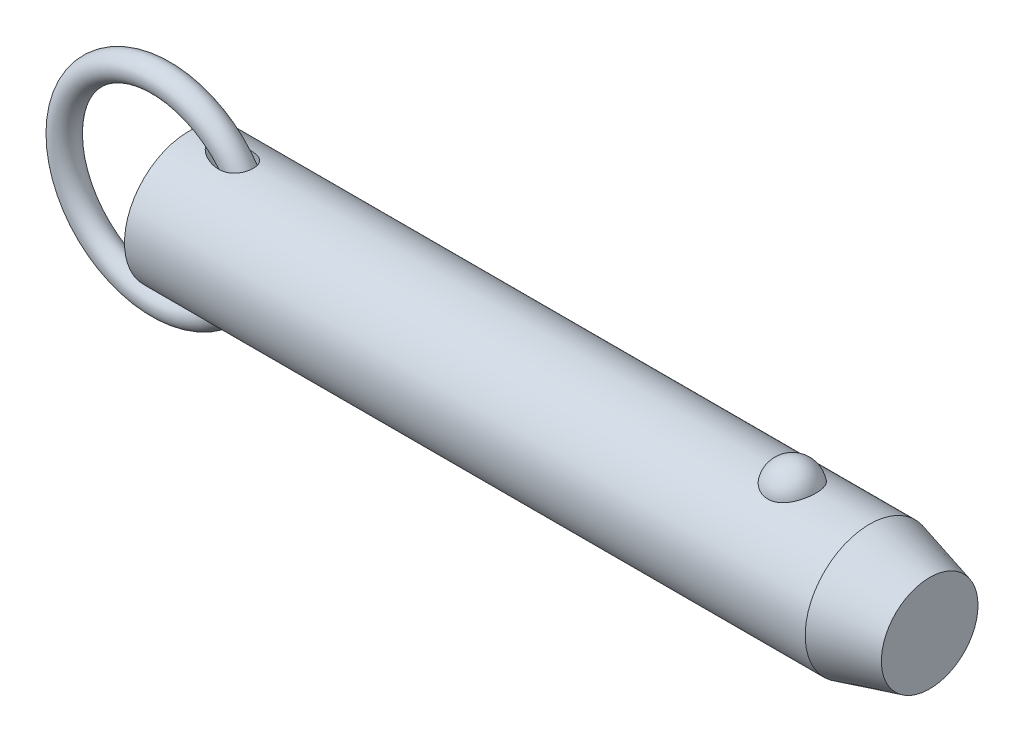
ISO-10303-21;
HEADER;
FILE_DESCRIPTION(('STEP AP214'),'2;1');
FILE_NAME('part.step','',(''),(''),'','','');
FILE_SCHEMA(('AUTOMOTIVE_DESIGN { 1 0 10303 214 1 1 1 1 }'));
ENDSEC;
DATA;
#1=APPLICATION_CONTEXT('core data for automotive mechanical design processes');
#2=APPLICATION_PROTOCOL_DEFINITION('international standard','automotive_design',2000,#1);
#3=PRODUCT_CONTEXT('',#1,'mechanical');
#4=PRODUCT('Part','Part','',(#3));
#5=PRODUCT_RELATED_PRODUCT_CATEGORY('part','',(#4));
#6=PRODUCT_DEFINITION_FORMATION('','',#4);
#7=PRODUCT_DEFINITION_CONTEXT('part definition',#1,'design');
#8=PRODUCT_DEFINITION('design','',#6,#7);
#9=PRODUCT_DEFINITION_SHAPE('','',#8);
#10=(LENGTH_UNIT() NAMED_UNIT(*) SI_UNIT(.MILLI.,.METRE.));
#11=(NAMED_UNIT(*) PLANE_ANGLE_UNIT() SI_UNIT($,.RADIAN.));
#12=(NAMED_UNIT(*) SI_UNIT($,.STERADIAN.) SOLID_ANGLE_UNIT());
#13=UNCERTAINTY_MEASURE_WITH_UNIT(LENGTH_MEASURE(1.E-05),#10,'distance_accuracy_value','');
#14=(GEOMETRIC_REPRESENTATION_CONTEXT(3) GLOBAL_UNCERTAINTY_ASSIGNED_CONTEXT((#13)) GLOBAL_UNIT_ASSIGNED_CONTEXT((#10,
#11,#12)) REPRESENTATION_CONTEXT('',''));
#15=CARTESIAN_POINT('',(0.,0.,0.));
#16=DIRECTION('',(0.,0.,1.));
#17=DIRECTION('',(1.,0.,0.));
#18=AXIS2_PLACEMENT_3D('',#15,#16,#17);
#19=CARTESIAN_POINT('',(-5.53898640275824,0.,0.));
#20=DIRECTION('',(0.,0.,1.));
#21=DIRECTION('',(1.,0.,0.));
#22=AXIS2_PLACEMENT_3D('',#19,#20,#21);
#23=TOROIDAL_SURFACE('',#22,19.05,2.54);
#24=CARTESIAN_POINT('',(16.0510135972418,0.,0.));
#25=VERTEX_POINT('',#24);
#26=VERTEX_LOOP('',#25);
#27=FACE_BOUND('',#26,.T.);
#28=ADVANCED_FACE('P0_F12',(#27),#23,.T.);
#29=CLOSED_SHELL('',(#28));
#30=MANIFOLD_SOLID_BREP('P0_B1',#29);
#31=CARTESIAN_POINT('',(0.,0.,0.));
#32=DIRECTION('',(1.,0.,0.));
#33=DIRECTION('',(0.,0.,-1.));
#34=AXIS2_PLACEMENT_3D('',#31,#32,#33);
#35=CYLINDRICAL_SURFACE('',#34,12.7);
#36=CARTESIAN_POINT('',(134.200738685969,0.,0.));
#37=DIRECTION('',(1.,0.,0.));
#38=DIRECTION('',(0.,0.,-1.));
#39=AXIS2_PLACEMENT_3D('',#36,#37,#38);
#40=CIRCLE('',#39,12.7);
#41=CARTESIAN_POINT('',(134.200738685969,0.,-12.7));
#42=VERTEX_POINT('',#41);
#43=EDGE_CURVE('P1_E89',#42,#42,#40,.T.);
#44=ORIENTED_EDGE('',*,*,#43,.F.);
#45=EDGE_LOOP('',(#44));
#46=FACE_BOUND('',#45,.T.);
#47=CARTESIAN_POINT('',(0.,0.,0.));
#48=DIRECTION('',(1.,0.,0.));
#49=DIRECTION('',(0.,0.,-1.));
#50=AXIS2_PLACEMENT_3D('',#47,#48,#49);
#51=CIRCLE('',#50,12.7);
#52=CARTESIAN_POINT('',(0.,0.,-12.7));
#53=VERTEX_POINT('',#52);
#54=EDGE_CURVE('P1_E52',#53,#53,#51,.T.);
#55=ORIENTED_EDGE('',*,*,#54,.T.);
#56=EDGE_LOOP('',(#55));
#57=FACE_BOUND('',#56,.T.);
#58=CARTESIAN_POINT('',(118.960042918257,11.7500437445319,4.81938502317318));
#59=CARTESIAN_POINT('',(118.835088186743,11.7500430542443,4.81938571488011));
#60=CARTESIAN_POINT('',(118.710144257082,11.7520975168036,4.81438658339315));
#61=CARTESIAN_POINT('',(118.461142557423,11.760253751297,4.79442904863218));
#62=CARTESIAN_POINT('',(118.337085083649,11.7663568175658,4.77946746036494));
#63=CARTESIAN_POINT('',(118.090901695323,11.7824262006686,4.7397141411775));
#64=CARTESIAN_POINT('',(117.968774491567,11.7923898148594,4.71492928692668));
#65=CARTESIAN_POINT('',(117.727187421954,11.8158938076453,4.65571340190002));
#66=CARTESIAN_POINT('',(117.60772859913,11.8294355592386,4.6212786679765));
#67=CARTESIAN_POINT('',(117.372557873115,11.8596812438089,4.54309502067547));
#68=CARTESIAN_POINT('',(117.256839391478,11.8763792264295,4.49936361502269));
#69=CARTESIAN_POINT('',(117.029653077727,11.9124878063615,4.40287235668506));
#70=CARTESIAN_POINT('',(116.918186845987,11.9318994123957,4.35010914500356));
#71=CARTESIAN_POINT('',(116.591278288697,11.9934256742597,4.17881316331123));
#72=CARTESIAN_POINT('',(116.383127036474,12.038858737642,4.04720756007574));
#73=CARTESIAN_POINT('',(115.985850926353,12.1352173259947,3.748564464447));
#74=CARTESIAN_POINT('',(115.797443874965,12.1862630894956,3.58061821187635));
#75=CARTESIAN_POINT('',(115.450521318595,12.2875163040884,3.21600758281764));
#76=CARTESIAN_POINT('',(115.292011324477,12.3377235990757,3.0193379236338));
#77=CARTESIAN_POINT('',(115.00168878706,12.434492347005,2.592916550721));
#78=CARTESIAN_POINT('',(114.871376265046,12.4807925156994,2.36208286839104));
#79=CARTESIAN_POINT('',(114.649407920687,12.5623454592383,1.88070399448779));
#80=CARTESIAN_POINT('',(114.557755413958,12.5975972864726,1.63015711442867));
#81=CARTESIAN_POINT('',(114.414046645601,12.6538414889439,1.1129886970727));
#82=CARTESIAN_POINT('',(114.362499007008,12.6746503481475,0.846205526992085));
#83=CARTESIAN_POINT('',(114.301977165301,12.699153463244,0.307085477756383));
#84=CARTESIAN_POINT('',(114.293001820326,12.7028481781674,0.0347487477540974));
#85=CARTESIAN_POINT('',(114.317731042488,12.6927785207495,-0.506073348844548));
#86=CARTESIAN_POINT('',(114.351189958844,12.6791146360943,-0.774571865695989));
#87=CARTESIAN_POINT('',(114.459687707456,12.635882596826,-1.30170246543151));
#88=CARTESIAN_POINT('',(114.53472729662,12.606314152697,-1.5603343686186));
#89=CARTESIAN_POINT('',(114.72500006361,12.5342328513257,-2.06083899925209));
#90=CARTESIAN_POINT('',(114.840287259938,12.4917026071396,-2.3026886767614));
#91=CARTESIAN_POINT('',(115.108704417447,12.3981123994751,-2.76259600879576));
#92=CARTESIAN_POINT('',(115.261837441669,12.3470517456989,-2.98065173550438));
#93=CARTESIAN_POINT('',(115.603507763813,12.2416045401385,-3.38786328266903));
#94=CARTESIAN_POINT('',(115.792201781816,12.1872040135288,-3.57688418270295));
#95=CARTESIAN_POINT('',(116.200239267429,12.0814086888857,-3.91941073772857));
#96=CARTESIAN_POINT('',(116.419580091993,12.0300136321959,-4.07291945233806));
#97=CARTESIAN_POINT('',(116.878375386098,11.9373542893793,-4.33691289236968));
#98=CARTESIAN_POINT('',(117.117304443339,11.8958982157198,-4.44824125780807));
#99=CARTESIAN_POINT('',(117.61243761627,11.8268116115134,-4.62881985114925));
#100=CARTESIAN_POINT('',(117.868635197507,11.7991758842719,-4.69808589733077));
#101=CARTESIAN_POINT('',(118.377164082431,11.7622209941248,-4.78983181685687));
#102=CARTESIAN_POINT('',(118.629041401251,11.7520502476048,-4.81449025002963));
#103=CARTESIAN_POINT('',(119.133573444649,11.7485796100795,-4.82295735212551));
#104=CARTESIAN_POINT('',(119.386228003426,11.7552763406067,-4.80677420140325));
#105=CARTESIAN_POINT('',(119.876834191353,11.7842584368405,-4.73525430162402));
#106=CARTESIAN_POINT('',(120.114998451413,11.8060486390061,-4.68116061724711));
#107=CARTESIAN_POINT('',(120.578489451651,11.8622750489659,-4.53678133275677));
#108=CARTESIAN_POINT('',(120.803815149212,11.8967122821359,-4.44649279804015));
#109=CARTESIAN_POINT('',(121.240801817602,11.9754603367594,-4.2298761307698));
#110=CARTESIAN_POINT('',(121.452057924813,12.0199699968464,-4.10280539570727));
#111=CARTESIAN_POINT('',(121.850601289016,12.1138028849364,-3.81685409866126));
#112=CARTESIAN_POINT('',(122.037883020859,12.163127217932,-3.65796622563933));
#113=CARTESIAN_POINT('',(122.393350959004,12.2642343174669,-3.30364864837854));
#114=CARTESIAN_POINT('',(122.560111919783,12.3160165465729,-3.10678783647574));
#115=CARTESIAN_POINT('',(122.859579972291,12.4142566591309,-2.68748409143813));
#116=CARTESIAN_POINT('',(122.992280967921,12.4607135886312,-2.46503658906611));
#117=CARTESIAN_POINT('',(123.224691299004,12.5450236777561,-1.99289519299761));
#118=CARTESIAN_POINT('',(123.323215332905,12.5825557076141,-1.7425591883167));
#119=CARTESIAN_POINT('',(123.479227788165,12.6431720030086,-1.22773734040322));
#120=CARTESIAN_POINT('',(123.536715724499,12.6662560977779,-0.963251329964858));
#121=CARTESIAN_POINT('',(123.609544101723,12.6956486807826,-0.427355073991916));
#122=CARTESIAN_POINT('',(123.624837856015,12.7019385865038,-0.155937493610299));
#123=CARTESIAN_POINT('',(123.612779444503,12.6970201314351,0.385928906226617));
#124=CARTESIAN_POINT('',(123.58542805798,12.6858120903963,0.656377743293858));
#125=CARTESIAN_POINT('',(123.513060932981,12.6568455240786,1.05454017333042));
#126=CARTESIAN_POINT('',(123.483796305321,12.6451962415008,1.18577850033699));
#127=CARTESIAN_POINT('',(123.415022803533,12.6181819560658,1.4451380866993));
#128=CARTESIAN_POINT('',(123.375517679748,12.6028183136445,1.57326046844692));
#129=CARTESIAN_POINT('',(123.286439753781,12.5687547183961,1.82554978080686));
#130=CARTESIAN_POINT('',(123.236862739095,12.5500533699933,1.9497150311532));
#131=CARTESIAN_POINT('',(123.12792115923,12.5098093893,2.1931437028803));
#132=CARTESIAN_POINT('',(123.068560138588,12.4882677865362,2.31240887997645));
#133=CARTESIAN_POINT('',(122.93997128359,12.4427679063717,2.54593031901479));
#134=CARTESIAN_POINT('',(122.870688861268,12.4187964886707,2.66015396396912));
#135=CARTESIAN_POINT('',(122.722903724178,12.3691892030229,2.88202659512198));
#136=CARTESIAN_POINT('',(122.644404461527,12.3435539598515,2.98967802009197));
#137=CARTESIAN_POINT('',(122.478550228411,12.2912955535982,3.19774385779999));
#138=CARTESIAN_POINT('',(122.391191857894,12.2646720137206,3.29815546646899));
#139=CARTESIAN_POINT('',(122.208161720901,12.2111945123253,3.49095035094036));
#140=CARTESIAN_POINT('',(122.112493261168,12.1843406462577,3.58333679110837));
#141=CARTESIAN_POINT('',(121.913627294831,12.1312249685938,3.75922876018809));
#142=CARTESIAN_POINT('',(121.810450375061,12.104961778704,3.84275713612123));
#143=CARTESIAN_POINT('',(121.59701336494,12.0537284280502,4.00056406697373));
#144=CARTESIAN_POINT('',(121.486756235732,12.028757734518,4.07484645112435));
#145=CARTESIAN_POINT('',(121.259755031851,11.9808306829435,4.21367959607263));
#146=CARTESIAN_POINT('',(121.143006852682,11.9578756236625,4.27822410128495));
#147=CARTESIAN_POINT('',(120.90394258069,11.9147184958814,4.39698483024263));
#148=CARTESIAN_POINT('',(120.781628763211,11.894515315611,4.45120522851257));
#149=CARTESIAN_POINT('',(120.522952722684,11.8561129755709,4.55255353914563));
#150=CARTESIAN_POINT('',(120.386223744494,11.8381764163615,4.59884858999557));
#151=CARTESIAN_POINT('',(120.108608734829,11.8069093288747,4.67853897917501));
#152=CARTESIAN_POINT('',(119.967724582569,11.7935767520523,4.71194005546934));
#153=CARTESIAN_POINT('',(119.68309446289,11.7720277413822,4.76552188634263));
#154=CARTESIAN_POINT('',(119.539348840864,11.7638106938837,4.78570422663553));
#155=CARTESIAN_POINT('',(119.250411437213,11.7528195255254,4.81263433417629));
#156=CARTESIAN_POINT('',(119.105219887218,11.7500445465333,4.81938421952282));
#157=CARTESIAN_POINT('',(118.960042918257,11.7500437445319,4.81938502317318));
#158=B_SPLINE_CURVE_WITH_KNOTS('',3,(#58,#59,#60,#61,#62,#63,#64,#65,#66,#67,#68,#69,#70,#71,
#72,#73,#74,#75,#76,#77,#78,#79,#80,#81,#82,#83,#84,#85,#86,#87,#88,#89,#90,#91,#92,#93,#94,#95,
#96,#97,#98,#99,#100,#101,#102,#103,#104,#105,#106,#107,#108,#109,#110,#111,#112,#113,#114,#115,
#116,#117,#118,#119,#120,#121,#122,#123,#124,#125,#126,#127,#128,#129,#130,#131,#132,#133,#134,
#135,#136,#137,#138,#139,#140,#141,#142,#143,#144,#145,#146,#147,#148,#149,#150,#151,#152,#153,
#154,#155,#156,#157),.UNSPECIFIED.,.T.,.F.,(4,2,2,2,2,2,2,2,2,2,2,2,2,2,2,2,2,2,2,2,2,2,2,2,2,2,
2,2,2,2,2,2,2,2,2,2,2,2,2,2,2,2,2,2,2,2,2,2,2,4),(0.,0.374729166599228,0.749578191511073,
1.12416526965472,1.49889629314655,1.87292776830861,2.24709865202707,2.99481328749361,
3.76399449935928,4.53331735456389,5.33683915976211,6.14042986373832,6.95405296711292,
7.76765424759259,8.57656703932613,9.38549455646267,10.1955119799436,11.0055949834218,
11.8193353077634,12.6330054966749,13.4294141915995,14.2255231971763,14.9815786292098,
15.7374826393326,16.4696948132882,17.2019663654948,17.9501979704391,18.6986017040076,
19.484470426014,20.2704797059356,21.0815215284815,21.8925729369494,22.7045213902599,
23.5164550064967,23.9209608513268,24.3253187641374,24.7298461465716,25.1342272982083,
25.54092555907,25.9474719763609,26.3541750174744,26.7607169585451,27.1661834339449,
27.5714814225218,27.9770386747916,28.3824315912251,28.8181206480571,29.2536155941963,
29.6890582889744,30.1244323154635),.UNSPECIFIED.);
#159=CARTESIAN_POINT('',(118.960042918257,11.7500437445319,4.81938502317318));
#160=VERTEX_POINT('',#159);
#161=EDGE_CURVE('P1_E80',#160,#160,#158,.T.);
#162=ORIENTED_EDGE('',*,*,#161,.T.);
#163=EDGE_LOOP('',(#162));
#164=FACE_BOUND('',#163,.T.);
#165=CARTESIAN_POINT('',(-5.53898640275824,0.,0.));
#166=DIRECTION('',(0.796400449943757,-0.604769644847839,0.));
#167=DIRECTION('',(0.604769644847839,0.796400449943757,0.));
#168=AXIS2_PLACEMENT_3D('',#165,#166,#167);
#169=ELLIPSE('',#168,15.9467514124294,12.7);
#170=CARTESIAN_POINT('',(4.09482149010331,12.6864319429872,0.586893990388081));
#171=VERTEX_POINT('',#170);
#172=CARTESIAN_POINT('',(4.09482149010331,12.6864319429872,-0.586893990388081));
#173=VERTEX_POINT('',#172);
#174=EDGE_CURVE('P1_E47',#171,#173,#169,.F.);
#175=ORIENTED_EDGE('',*,*,#174,.T.);
#176=CARTESIAN_POINT('',(4.06153170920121,12.6905758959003,-0.48916605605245));
#177=CARTESIAN_POINT('',(4.08111374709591,12.6881366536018,-0.552489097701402));
#178=CARTESIAN_POINT('',(4.10417851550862,12.6852663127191,-0.614604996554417));
#179=CARTESIAN_POINT('',(4.15628434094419,12.6787965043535,-0.736067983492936));
#180=CARTESIAN_POINT('',(4.18531032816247,12.6751988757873,-0.795421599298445));
#181=CARTESIAN_POINT('',(4.2791115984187,12.6636052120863,-0.967590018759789));
#182=CARTESIAN_POINT('',(4.35123408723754,12.654730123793,-1.07635920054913));
#183=CARTESIAN_POINT('',(4.49106800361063,12.6376715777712,-1.25922957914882));
#184=CARTESIAN_POINT('',(4.55601066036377,12.6297947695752,-1.33556751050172));
#185=CARTESIAN_POINT('',(4.69223626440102,12.6134116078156,-1.4823274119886));
#186=CARTESIAN_POINT('',(4.76352147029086,12.6049050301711,-1.55274725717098));
#187=CARTESIAN_POINT('',(4.91163946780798,12.587417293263,-1.68868704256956));
#188=CARTESIAN_POINT('',(4.98851399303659,12.5784327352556,-1.75416062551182));
#189=CARTESIAN_POINT('',(5.14630057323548,12.560235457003,-1.88003275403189));
#190=CARTESIAN_POINT('',(5.2272139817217,12.5510226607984,-1.94042957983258));
#191=CARTESIAN_POINT('',(5.45368877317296,12.5256514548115,-2.09966332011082));
#192=CARTESIAN_POINT('',(5.60261616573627,12.5094182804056,-2.19371988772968));
#193=CARTESIAN_POINT('',(5.90795545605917,12.4774211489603,-2.36893890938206));
#194=CARTESIAN_POINT('',(6.06437232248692,12.4616575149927,-2.45009264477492));
#195=CARTESIAN_POINT('',(6.38306132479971,12.431227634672,-2.6000824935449));
#196=CARTESIAN_POINT('',(6.54533237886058,12.4165611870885,-2.66892086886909));
#197=CARTESIAN_POINT('',(6.87462618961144,12.3889351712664,-2.79435199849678));
#198=CARTESIAN_POINT('',(7.04164773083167,12.3759751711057,-2.85094785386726));
#199=CARTESIAN_POINT('',(7.38726647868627,12.3518460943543,-2.95377962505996));
#200=CARTESIAN_POINT('',(7.56604577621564,12.3407843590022,-2.99943209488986));
#201=CARTESIAN_POINT('',(7.92698692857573,12.3219309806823,-3.07596683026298));
#202=CARTESIAN_POINT('',(8.10914972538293,12.314140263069,-3.10684491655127));
#203=CARTESIAN_POINT('',(8.47511457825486,12.3025918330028,-3.15226850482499));
#204=CARTESIAN_POINT('',(8.65890979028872,12.2988216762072,-3.16686440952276));
#205=CARTESIAN_POINT('',(9.02696087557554,12.2959421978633,-3.17802250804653));
#206=CARTESIAN_POINT('',(9.21121628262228,12.2968292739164,-3.17459864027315));
#207=CARTESIAN_POINT('',(9.61636263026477,12.3045198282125,-3.14471110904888));
#208=CARTESIAN_POINT('',(9.83695552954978,12.3125080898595,-3.11363232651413));
#209=CARTESIAN_POINT('',(10.1619126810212,12.3303028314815,-3.04206574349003));
#210=CARTESIAN_POINT('',(10.2692747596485,12.3372061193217,-3.01403983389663));
#211=CARTESIAN_POINT('',(10.4811758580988,12.3528538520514,-2.94925947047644));
#212=CARTESIAN_POINT('',(10.5857162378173,12.361597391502,-2.91250930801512));
#213=CARTESIAN_POINT('',(10.792132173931,12.3808585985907,-2.8295174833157));
#214=CARTESIAN_POINT('',(10.8939665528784,12.3913944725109,-2.78317723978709));
#215=CARTESIAN_POINT('',(11.092611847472,12.4138762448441,-2.68112002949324));
#216=CARTESIAN_POINT('',(11.1894254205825,12.4258213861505,-2.62540809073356));
#217=CARTESIAN_POINT('',(11.3768740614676,12.4507225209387,-2.50465655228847));
#218=CARTESIAN_POINT('',(11.4675115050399,12.4636781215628,-2.43962056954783));
#219=CARTESIAN_POINT('',(11.6414572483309,12.4901070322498,-2.30048560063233));
#220=CARTESIAN_POINT('',(11.7247669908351,12.5035802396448,-2.22638840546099));
#221=CARTESIAN_POINT('',(11.8713131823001,12.5285000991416,-2.08117367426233));
#222=CARTESIAN_POINT('',(11.9357009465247,12.5399538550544,-2.01121596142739));
#223=CARTESIAN_POINT('',(12.0576805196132,12.5624496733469,-1.86555293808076));
#224=CARTESIAN_POINT('',(12.1152732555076,12.5734917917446,-1.7898484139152));
#225=CARTESIAN_POINT('',(12.223073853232,12.5947858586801,-1.63327883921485));
#226=CARTESIAN_POINT('',(12.2732844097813,12.6050380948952,-1.5524156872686));
#227=CARTESIAN_POINT('',(12.3658430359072,12.6243983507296,-1.38621267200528));
#228=CARTESIAN_POINT('',(12.4081916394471,12.6335064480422,-1.30087311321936));
#229=CARTESIAN_POINT('',(12.5150098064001,12.6569076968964,-1.05702619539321));
#230=CARTESIAN_POINT('',(12.5703399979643,12.6695746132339,-0.894232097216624));
#231=CARTESIAN_POINT('',(12.6526225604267,12.6886816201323,-0.561391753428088));
#232=CARTESIAN_POINT('',(12.6795825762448,12.6951233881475,-0.39134747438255));
#233=CARTESIAN_POINT('',(12.7041016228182,12.7009766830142,-0.0537636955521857));
#234=CARTESIAN_POINT('',(12.7024538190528,12.7005778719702,0.113714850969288));
#235=CARTESIAN_POINT('',(12.6717240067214,12.6932548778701,0.445979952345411));
#236=CARTESIAN_POINT('',(12.6426435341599,12.6863310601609,0.610766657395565));
#237=CARTESIAN_POINT('',(12.5579769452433,12.6667465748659,0.932429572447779));
#238=CARTESIAN_POINT('',(12.5024793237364,12.6541050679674,1.08933027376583));
#239=CARTESIAN_POINT('',(12.3665691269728,12.6244558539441,1.39146752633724));
#240=CARTESIAN_POINT('',(12.2861577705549,12.6074483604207,1.53670464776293));
#241=CARTESIAN_POINT('',(12.1018203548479,12.5706804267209,1.81319588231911));
#242=CARTESIAN_POINT('',(11.9976588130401,12.5508932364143,1.94428915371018));
#243=CARTESIAN_POINT('',(11.7695265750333,12.5107540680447,2.18776051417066));
#244=CARTESIAN_POINT('',(11.6455540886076,12.4904020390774,2.3001369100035));
#245=CARTESIAN_POINT('',(11.3759347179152,12.4502278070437,2.50870972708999));
#246=CARTESIAN_POINT('',(11.2295880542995,12.4304654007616,2.60400962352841));
#247=CARTESIAN_POINT('',(10.9239803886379,12.3941696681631,2.77162929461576));
#248=CARTESIAN_POINT('',(10.7647152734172,12.3776373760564,2.84394171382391));
#249=CARTESIAN_POINT('',(10.4192039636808,12.3473062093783,2.97303525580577));
#250=CARTESIAN_POINT('',(10.2319332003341,12.3340204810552,3.027171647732));
#251=CARTESIAN_POINT('',(9.85152982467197,12.3134301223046,3.10986173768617));
#252=CARTESIAN_POINT('',(9.65839336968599,12.3061295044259,3.13839827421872));
#253=CARTESIAN_POINT('',(9.31022514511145,12.2982822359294,3.16897517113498));
#254=CARTESIAN_POINT('',(9.1555571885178,12.2966525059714,3.17526894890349));
#255=CARTESIAN_POINT('',(8.84618945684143,12.2967963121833,3.17471335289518));
#256=CARTESIAN_POINT('',(8.69148970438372,12.2985715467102,3.16785742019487));
#257=CARTESIAN_POINT('',(8.38280471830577,12.3051648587,3.14214692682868));
#258=CARTESIAN_POINT('',(8.22882218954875,12.3099904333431,3.12326280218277));
#259=CARTESIAN_POINT('',(7.92276070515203,12.3222644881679,3.07448013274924));
#260=CARTESIAN_POINT('',(7.770681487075,12.3297126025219,3.04458312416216));
#261=CARTESIAN_POINT('',(7.46452663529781,12.3470493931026,2.97350781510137));
#262=CARTESIAN_POINT('',(7.31052714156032,12.3570043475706,2.93201910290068));
#263=CARTESIAN_POINT('',(7.00579083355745,12.3787609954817,2.83876185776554));
#264=CARTESIAN_POINT('',(6.85505451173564,12.3905629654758,2.78699178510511));
#265=CARTESIAN_POINT('',(6.55781208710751,12.415528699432,2.67357744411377));
#266=CARTESIAN_POINT('',(6.41129783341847,12.4286895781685,2.61195394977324));
#267=CARTESIAN_POINT('',(6.12302950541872,12.4559398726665,2.47874512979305));
#268=CARTESIAN_POINT('',(5.9812739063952,12.4700289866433,2.40716303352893));
#269=CARTESIAN_POINT('',(5.67073126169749,12.5020754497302,2.23550426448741));
#270=CARTESIAN_POINT('',(5.50343839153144,12.5201625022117,2.13268685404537));
#271=CARTESIAN_POINT('',(5.26147616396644,12.5471537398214,1.96522579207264));
#272=CARTESIAN_POINT('',(5.18224299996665,12.5561365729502,1.90713440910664));
#273=CARTESIAN_POINT('',(5.02746475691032,12.5739122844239,1.78618989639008));
#274=CARTESIAN_POINT('',(4.95191912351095,12.5827051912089,1.72333748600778));
#275=CARTESIAN_POINT('',(4.81787163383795,12.598469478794,1.60360864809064));
#276=CARTESIAN_POINT('',(4.75865966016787,12.6054958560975,1.54753994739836));
#277=CARTESIAN_POINT('',(4.64406285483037,12.6191906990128,1.43158546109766));
#278=CARTESIAN_POINT('',(4.58867926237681,12.6258590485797,1.37169845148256));
#279=CARTESIAN_POINT('',(4.43014912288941,12.6450546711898,1.18656670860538));
#280=CARTESIAN_POINT('',(4.33372726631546,12.6568788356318,1.05507993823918));
#281=CARTESIAN_POINT('',(4.21252055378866,12.6718304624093,0.848052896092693));
#282=CARTESIAN_POINT('',(4.17660155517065,12.6762773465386,0.779100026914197));
#283=CARTESIAN_POINT('',(4.11264979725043,12.6842122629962,0.637080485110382));
#284=CARTESIAN_POINT('',(4.0846679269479,12.6876941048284,0.563990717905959));
#285=CARTESIAN_POINT('',(4.06153170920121,12.6905758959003,0.489166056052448));
#286=B_SPLINE_CURVE_WITH_KNOTS('',3,(#176,#177,#178,#179,#180,#181,#182,#183,#184,#185,#186,
#187,#188,#189,#190,#191,#192,#193,#194,#195,#196,#197,#198,#199,#200,#201,#202,#203,#204,#205,
#206,#207,#208,#209,#210,#211,#212,#213,#214,#215,#216,#217,#218,#219,#220,#221,#222,#223,#224,
#225,#226,#227,#228,#229,#230,#231,#232,#233,#234,#235,#236,#237,#238,#239,#240,#241,#242,#243,
#244,#245,#246,#247,#248,#249,#250,#251,#252,#253,#254,#255,#256,#257,#258,#259,#260,#261,#262,
#263,#264,#265,#266,#267,#268,#269,#270,#271,#272,#273,#274,#275,#276,#277,#278,#279,#280,#281,
#282,#283,#284,#285),.UNSPECIFIED.,.F.,.F.,(4,2,2,2,2,2,2,2,2,2,2,2,2,2,2,2,2,2,2,2,2,2,2,2,2,2,
2,2,2,2,2,2,2,2,2,2,2,2,2,2,2,2,2,2,2,2,2,2,2,2,2,2,2,2,4),(0.,0.198708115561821,
0.39691995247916,0.787580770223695,1.08882492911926,1.3901767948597,1.69407136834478,
1.9980684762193,2.52793143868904,3.05815092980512,3.58827293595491,4.1182605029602,
4.67218806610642,5.22627222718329,5.77863637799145,6.33057333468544,6.99657211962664,
7.32977411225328,7.66281254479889,7.99946156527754,8.33593054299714,8.6722693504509,
9.00854178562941,9.29544181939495,9.58230266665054,9.86905853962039,10.155794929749,
10.670233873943,11.184534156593,11.6845985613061,12.1846349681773,12.6830079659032,
13.1813565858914,13.6848795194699,14.1884479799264,14.7135333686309,15.2387866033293,
15.8228373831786,16.4072794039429,16.8710810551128,17.3351141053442,17.8002921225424,
18.2654052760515,18.7444169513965,19.2235004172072,19.7015868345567,20.1795185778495,
20.7699825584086,21.0658110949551,21.361595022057,21.6069574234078,21.8523988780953,
22.3397467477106,22.5729183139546,22.8075527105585),.UNSPECIFIED.);
#287=EDGE_CURVE('P1_E51',#173,#171,#286,.T.);
#288=ORIENTED_EDGE('',*,*,#287,.T.);
#289=EDGE_LOOP('',(#175,#288));
#290=FACE_BOUND('',#289,.T.);
#291=CARTESIAN_POINT('',(-5.53898640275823,0.,0.));
#292=DIRECTION('',(-0.796400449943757,-0.604769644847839,0.));
#293=DIRECTION('',(0.604769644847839,-0.796400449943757,0.));
#294=AXIS2_PLACEMENT_3D('',#291,#292,#293);
#295=ELLIPSE('',#294,15.9467514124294,12.7);
#296=CARTESIAN_POINT('',(4.09482149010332,-12.6864319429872,0.586893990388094));
#297=VERTEX_POINT('',#296);
#298=CARTESIAN_POINT('',(4.09482149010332,-12.6864319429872,-0.586893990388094));
#299=VERTEX_POINT('',#298);
#300=EDGE_CURVE('P1_E28',#297,#299,#295,.F.);
#301=ORIENTED_EDGE('',*,*,#300,.F.);
#302=CARTESIAN_POINT('',(4.06153170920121,-12.6905758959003,0.489166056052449));
#303=CARTESIAN_POINT('',(4.08111374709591,-12.6881366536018,0.552489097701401));
#304=CARTESIAN_POINT('',(4.10417851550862,-12.6852663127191,0.614604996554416));
#305=CARTESIAN_POINT('',(4.15628434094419,-12.6787965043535,0.736067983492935));
#306=CARTESIAN_POINT('',(4.18531032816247,-12.6751988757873,0.795421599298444));
#307=CARTESIAN_POINT('',(4.2791115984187,-12.6636052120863,0.967590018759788));
#308=CARTESIAN_POINT('',(4.35123408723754,-12.654730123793,1.07635920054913));
#309=CARTESIAN_POINT('',(4.49106800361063,-12.6376715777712,1.25922957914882));
#310=CARTESIAN_POINT('',(4.55601066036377,-12.6297947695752,1.33556751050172));
#311=CARTESIAN_POINT('',(4.69223626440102,-12.6134116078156,1.48232741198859));
#312=CARTESIAN_POINT('',(4.76352147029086,-12.6049050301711,1.55274725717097));
#313=CARTESIAN_POINT('',(4.91163946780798,-12.587417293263,1.68868704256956));
#314=CARTESIAN_POINT('',(4.98851399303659,-12.5784327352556,1.75416062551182));
#315=CARTESIAN_POINT('',(5.14630057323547,-12.560235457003,1.88003275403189));
#316=CARTESIAN_POINT('',(5.2272139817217,-12.5510226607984,1.94042957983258));
#317=CARTESIAN_POINT('',(5.45368877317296,-12.5256514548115,2.09966332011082));
#318=CARTESIAN_POINT('',(5.60261616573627,-12.5094182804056,2.19371988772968));
#319=CARTESIAN_POINT('',(5.90795545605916,-12.4774211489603,2.36893890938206));
#320=CARTESIAN_POINT('',(6.06437232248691,-12.4616575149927,2.45009264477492));
#321=CARTESIAN_POINT('',(6.3830613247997,-12.431227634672,2.6000824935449));
#322=CARTESIAN_POINT('',(6.54533237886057,-12.4165611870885,2.66892086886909));
#323=CARTESIAN_POINT('',(6.87462618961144,-12.3889351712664,2.79435199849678));
#324=CARTESIAN_POINT('',(7.04164773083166,-12.3759751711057,2.85094785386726));
#325=CARTESIAN_POINT('',(7.38726647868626,-12.3518460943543,2.95377962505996));
#326=CARTESIAN_POINT('',(7.56604577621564,-12.3407843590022,2.99943209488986));
#327=CARTESIAN_POINT('',(7.92698692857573,-12.3219309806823,3.07596683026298));
#328=CARTESIAN_POINT('',(8.10914972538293,-12.314140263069,3.10684491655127));
#329=CARTESIAN_POINT('',(8.47511457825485,-12.3025918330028,3.15226850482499));
#330=CARTESIAN_POINT('',(8.65890979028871,-12.2988216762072,3.16686440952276));
#331=CARTESIAN_POINT('',(9.02696087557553,-12.2959421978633,3.17802250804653));
#332=CARTESIAN_POINT('',(9.21121628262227,-12.2968292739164,3.17459864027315));
#333=CARTESIAN_POINT('',(9.61636263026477,-12.3045198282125,3.14471110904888));
#334=CARTESIAN_POINT('',(9.83695552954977,-12.3125080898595,3.11363232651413));
#335=CARTESIAN_POINT('',(10.1619126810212,-12.3303028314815,3.04206574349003));
#336=CARTESIAN_POINT('',(10.2692747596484,-12.3372061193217,3.01403983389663));
#337=CARTESIAN_POINT('',(10.4811758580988,-12.3528538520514,2.94925947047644));
#338=CARTESIAN_POINT('',(10.5857162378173,-12.361597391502,2.91250930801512));
#339=CARTESIAN_POINT('',(10.792132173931,-12.3808585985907,2.8295174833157));
#340=CARTESIAN_POINT('',(10.8939665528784,-12.3913944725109,2.78317723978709));
#341=CARTESIAN_POINT('',(11.092611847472,-12.4138762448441,2.68112002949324));
#342=CARTESIAN_POINT('',(11.1894254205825,-12.4258213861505,2.62540809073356));
#343=CARTESIAN_POINT('',(11.3768740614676,-12.4507225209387,2.50465655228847));
#344=CARTESIAN_POINT('',(11.4675115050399,-12.4636781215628,2.43962056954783));
#345=CARTESIAN_POINT('',(11.6414572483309,-12.4901070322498,2.30048560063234));
#346=CARTESIAN_POINT('',(11.7247669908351,-12.5035802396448,2.22638840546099));
#347=CARTESIAN_POINT('',(11.8713131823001,-12.5285000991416,2.08117367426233));
#348=CARTESIAN_POINT('',(11.9357009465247,-12.5399538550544,2.01121596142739));
#349=CARTESIAN_POINT('',(12.0576805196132,-12.5624496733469,1.86555293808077));
#350=CARTESIAN_POINT('',(12.1152732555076,-12.5734917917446,1.7898484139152));
#351=CARTESIAN_POINT('',(12.223073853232,-12.5947858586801,1.63327883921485));
#352=CARTESIAN_POINT('',(12.2732844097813,-12.6050380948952,1.5524156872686));
#353=CARTESIAN_POINT('',(12.3658430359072,-12.6243983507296,1.38621267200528));
#354=CARTESIAN_POINT('',(12.4081916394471,-12.6335064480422,1.30087311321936));
#355=CARTESIAN_POINT('',(12.5150098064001,-12.6569076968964,1.05702619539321));
#356=CARTESIAN_POINT('',(12.5703399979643,-12.6695746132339,0.894232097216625));
#357=CARTESIAN_POINT('',(12.6526225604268,-12.6886816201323,0.561391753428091));
#358=CARTESIAN_POINT('',(12.6795825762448,-12.6951233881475,0.391347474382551));
#359=CARTESIAN_POINT('',(12.7041016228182,-12.7009766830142,0.0537636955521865));
#360=CARTESIAN_POINT('',(12.7024538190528,-12.7005778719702,-0.113714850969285));
#361=CARTESIAN_POINT('',(12.6717240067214,-12.6932548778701,-0.445979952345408));
#362=CARTESIAN_POINT('',(12.6426435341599,-12.6863310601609,-0.610766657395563));
#363=CARTESIAN_POINT('',(12.5579769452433,-12.6667465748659,-0.932429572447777));
#364=CARTESIAN_POINT('',(12.5024793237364,-12.6541050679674,-1.08933027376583));
#365=CARTESIAN_POINT('',(12.3665691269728,-12.6244558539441,-1.39146752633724));
#366=CARTESIAN_POINT('',(12.2861577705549,-12.6074483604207,-1.53670464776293));
#367=CARTESIAN_POINT('',(12.1018203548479,-12.5706804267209,-1.81319588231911));
#368=CARTESIAN_POINT('',(11.9976588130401,-12.5508932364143,-1.94428915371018));
#369=CARTESIAN_POINT('',(11.7695265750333,-12.5107540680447,-2.18776051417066));
#370=CARTESIAN_POINT('',(11.6455540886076,-12.4904020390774,-2.3001369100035));
#371=CARTESIAN_POINT('',(11.3759347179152,-12.4502278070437,-2.50870972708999));
#372=CARTESIAN_POINT('',(11.2295880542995,-12.4304654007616,-2.60400962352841));
#373=CARTESIAN_POINT('',(10.9239803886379,-12.3941696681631,-2.77162929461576));
#374=CARTESIAN_POINT('',(10.7647152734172,-12.3776373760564,-2.84394171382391));
#375=CARTESIAN_POINT('',(10.4192039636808,-12.3473062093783,-2.97303525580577));
#376=CARTESIAN_POINT('',(10.2319332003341,-12.3340204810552,-3.027171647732));
#377=CARTESIAN_POINT('',(9.85152982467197,-12.3134301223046,-3.10986173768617));
#378=CARTESIAN_POINT('',(9.658393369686,-12.3061295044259,-3.13839827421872));
#379=CARTESIAN_POINT('',(9.31022514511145,-12.2982822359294,-3.16897517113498));
#380=CARTESIAN_POINT('',(9.1555571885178,-12.2966525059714,-3.17526894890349));
#381=CARTESIAN_POINT('',(8.84618945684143,-12.2967963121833,-3.17471335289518));
#382=CARTESIAN_POINT('',(8.69148970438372,-12.2985715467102,-3.16785742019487));
#383=CARTESIAN_POINT('',(8.38280471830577,-12.3051648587,-3.14214692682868));
#384=CARTESIAN_POINT('',(8.22882218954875,-12.3099904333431,-3.12326280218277));
#385=CARTESIAN_POINT('',(7.92276070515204,-12.3222644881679,-3.07448013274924));
#386=CARTESIAN_POINT('',(7.77068148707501,-12.3297126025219,-3.04458312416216));
#387=CARTESIAN_POINT('',(7.46452663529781,-12.3470493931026,-2.97350781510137));
#388=CARTESIAN_POINT('',(7.31052714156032,-12.3570043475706,-2.93201910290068));
#389=CARTESIAN_POINT('',(7.00579083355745,-12.3787609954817,-2.83876185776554));
#390=CARTESIAN_POINT('',(6.85505451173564,-12.3905629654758,-2.78699178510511));
#391=CARTESIAN_POINT('',(6.55781208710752,-12.415528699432,-2.67357744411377));
#392=CARTESIAN_POINT('',(6.41129783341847,-12.4286895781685,-2.61195394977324));
#393=CARTESIAN_POINT('',(6.12302950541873,-12.4559398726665,-2.47874512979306));
#394=CARTESIAN_POINT('',(5.98127390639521,-12.4700289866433,-2.40716303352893));
#395=CARTESIAN_POINT('',(5.6707312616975,-12.5020754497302,-2.23550426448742));
#396=CARTESIAN_POINT('',(5.50343839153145,-12.5201625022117,-2.13268685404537));
#397=CARTESIAN_POINT('',(5.26147616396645,-12.5471537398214,-1.96522579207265));
#398=CARTESIAN_POINT('',(5.18224299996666,-12.5561365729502,-1.90713440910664));
#399=CARTESIAN_POINT('',(5.02746475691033,-12.5739122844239,-1.78618989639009));
#400=CARTESIAN_POINT('',(4.95191912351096,-12.5827051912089,-1.72333748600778));
#401=CARTESIAN_POINT('',(4.81787163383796,-12.598469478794,-1.60360864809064));
#402=CARTESIAN_POINT('',(4.75865966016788,-12.6054958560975,-1.54753994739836));
#403=CARTESIAN_POINT('',(4.64406285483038,-12.6191906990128,-1.43158546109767));
#404=CARTESIAN_POINT('',(4.58867926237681,-12.6258590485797,-1.37169845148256));
#405=CARTESIAN_POINT('',(4.43014912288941,-12.6450546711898,-1.18656670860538));
#406=CARTESIAN_POINT('',(4.33372726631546,-12.6568788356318,-1.05507993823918));
#407=CARTESIAN_POINT('',(4.21252055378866,-12.6718304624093,-0.848052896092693));
#408=CARTESIAN_POINT('',(4.17660155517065,-12.6762773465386,-0.779100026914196));
#409=CARTESIAN_POINT('',(4.11264979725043,-12.6842122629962,-0.637080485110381));
#410=CARTESIAN_POINT('',(4.0846679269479,-12.6876941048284,-0.563990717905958));
#411=CARTESIAN_POINT('',(4.06153170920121,-12.6905758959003,-0.489166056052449));
#412=B_SPLINE_CURVE_WITH_KNOTS('',3,(#302,#303,#304,#305,#306,#307,#308,#309,#310,#311,#312,
#313,#314,#315,#316,#317,#318,#319,#320,#321,#322,#323,#324,#325,#326,#327,#328,#329,#330,#331,
#332,#333,#334,#335,#336,#337,#338,#339,#340,#341,#342,#343,#344,#345,#346,#347,#348,#349,#350,
#351,#352,#353,#354,#355,#356,#357,#358,#359,#360,#361,#362,#363,#364,#365,#366,#367,#368,#369,
#370,#371,#372,#373,#374,#375,#376,#377,#378,#379,#380,#381,#382,#383,#384,#385,#386,#387,#388,
#389,#390,#391,#392,#393,#394,#395,#396,#397,#398,#399,#400,#401,#402,#403,#404,#405,#406,#407,
#408,#409,#410,#411),.UNSPECIFIED.,.F.,.F.,(4,2,2,2,2,2,2,2,2,2,2,2,2,2,2,2,2,2,2,2,2,2,2,2,2,2,
2,2,2,2,2,2,2,2,2,2,2,2,2,2,2,2,2,2,2,2,2,2,2,2,2,2,2,2,4),(0.,0.198708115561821,
0.39691995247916,0.787580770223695,1.08882492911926,1.3901767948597,1.69407136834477,
1.9980684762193,2.52793143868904,3.05815092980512,3.5882729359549,4.1182605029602,
4.67218806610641,5.22627222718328,5.77863637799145,6.33057333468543,6.99657211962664,
7.32977411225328,7.66281254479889,7.99946156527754,8.33593054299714,8.67226935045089,
9.00854178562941,9.29544181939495,9.58230266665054,9.86905853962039,10.155794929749,
10.670233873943,11.184534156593,11.6845985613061,12.1846349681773,12.6830079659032,
13.1813565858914,13.6848795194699,14.1884479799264,14.7135333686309,15.2387866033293,
15.8228373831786,16.4072794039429,16.8710810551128,17.3351141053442,17.8002921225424,
18.2654052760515,18.7444169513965,19.2235004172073,19.7015868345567,20.1795185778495,
20.7699825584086,21.0658110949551,21.361595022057,21.6069574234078,21.8523988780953,
22.3397467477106,22.5729183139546,22.8075527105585),.UNSPECIFIED.);
#413=EDGE_CURVE('P1_E10',#297,#299,#412,.T.);
#414=ORIENTED_EDGE('',*,*,#413,.T.);
#415=EDGE_LOOP('',(#301,#414));
#416=FACE_BOUND('',#415,.T.);
#417=ADVANCED_FACE('P1_F15',(#46,#57,#164,#290,#416),#35,.T.);
#418=CARTESIAN_POINT('',(0.,0.,0.));
#419=DIRECTION('',(-1.,0.,0.));
#420=DIRECTION('',(0.,0.,1.));
#421=AXIS2_PLACEMENT_3D('',#418,#419,#420);
#422=PLANE('',#421);
#423=ORIENTED_EDGE('',*,*,#54,.F.);
#424=EDGE_LOOP('',(#423));
#425=FACE_BOUND('',#424,.T.);
#426=ADVANCED_FACE('P1_F17',(#425),#422,.T.);
#427=CARTESIAN_POINT('',(146.05,0.,0.));
#428=DIRECTION('',(-1.,0.,0.));
#429=DIRECTION('',(0.,0.,1.));
#430=AXIS2_PLACEMENT_3D('',#427,#428,#429);
#431=CONICAL_SURFACE('',#430,9.52500000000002,0.26179938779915);
#432=ORIENTED_EDGE('',*,*,#43,.T.);
#433=EDGE_LOOP('',(#432));
#434=FACE_BOUND('',#433,.T.);
#435=CARTESIAN_POINT('',(146.05,0.,0.));
#436=DIRECTION('',(1.,0.,0.));
#437=DIRECTION('',(0.,0.,-1.));
#438=AXIS2_PLACEMENT_3D('',#435,#436,#437);
#439=CIRCLE('',#438,9.52500000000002);
#440=CARTESIAN_POINT('',(146.05,0.,-9.52500000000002));
#441=VERTEX_POINT('',#440);
#442=EDGE_CURVE('P1_E86',#441,#441,#439,.T.);
#443=ORIENTED_EDGE('',*,*,#442,.F.);
#444=EDGE_LOOP('',(#443));
#445=FACE_BOUND('',#444,.T.);
#446=ADVANCED_FACE('P1_F105',(#434,#445),#431,.T.);
#447=CARTESIAN_POINT('',(146.05,9.52500000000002,0.));
#448=DIRECTION('',(1.,0.,0.));
#449=DIRECTION('',(0.,0.,-1.));
#450=AXIS2_PLACEMENT_3D('',#447,#448,#449);
#451=PLANE('',#450);
#452=ORIENTED_EDGE('',*,*,#442,.T.);
#453=EDGE_LOOP('',(#452));
#454=FACE_BOUND('',#453,.T.);
#455=ADVANCED_FACE('P1_F78',(#454),#451,.T.);
#456=CARTESIAN_POINT('',(118.960042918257,11.43,0.));
#457=DIRECTION('',(-1.,0.,0.));
#458=DIRECTION('',(0.,1.,0.));
#459=AXIS2_PLACEMENT_3D('',#456,#457,#458);
#460=SPHERICAL_SURFACE('',#459,4.83);
#461=ORIENTED_EDGE('',*,*,#161,.F.);
#462=EDGE_LOOP('',(#461));
#463=FACE_BOUND('',#462,.T.);
#464=ADVANCED_FACE('P1_F71',(#463),#460,.T.);
#465=CARTESIAN_POINT('',(-5.53898640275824,0.,0.));
#466=DIRECTION('',(0.,0.,1.));
#467=DIRECTION('',(1.,0.,0.));
#468=AXIS2_PLACEMENT_3D('',#465,#466,#467);
#469=TOROIDAL_SURFACE('',#468,19.05,3.175);
#470=CARTESIAN_POINT('',(5.98187533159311,-15.1714285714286,0.));
#471=DIRECTION('',(-0.796400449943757,-0.604769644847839,0.));
#472=DIRECTION('',(0.604769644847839,-0.796400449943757,0.));
#473=AXIS2_PLACEMENT_3D('',#470,#471,#472);
#474=CIRCLE('',#473,3.175);
#475=EDGE_CURVE('P1_E34',#297,#299,#474,.T.);
#476=ORIENTED_EDGE('',*,*,#475,.T.);
#477=ORIENTED_EDGE('',*,*,#413,.F.);
#478=EDGE_LOOP('',(#476,#477));
#479=FACE_BOUND('',#478,.T.);
#480=CARTESIAN_POINT('',(5.9818753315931,15.1714285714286,0.));
#481=DIRECTION('',(0.796400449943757,-0.604769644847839,0.));
#482=DIRECTION('',(0.604769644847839,0.796400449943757,0.));
#483=AXIS2_PLACEMENT_3D('',#480,#481,#482);
#484=CIRCLE('',#483,3.175);
#485=EDGE_CURVE('P1_E41',#171,#173,#484,.T.);
#486=ORIENTED_EDGE('',*,*,#485,.F.);
#487=ORIENTED_EDGE('',*,*,#287,.F.);
#488=EDGE_LOOP('',(#486,#487));
#489=FACE_BOUND('',#488,.T.);
#490=ADVANCED_FACE('P1_F55',(#479,#489),#469,.F.);
#491=CARTESIAN_POINT('',(5.98187533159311,-15.1714285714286,0.));
#492=DIRECTION('',(-0.796400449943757,-0.604769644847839,0.));
#493=DIRECTION('',(0.604769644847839,-0.796400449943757,0.));
#494=AXIS2_PLACEMENT_3D('',#491,#492,#493);
#495=PLANE('',#494);
#496=ORIENTED_EDGE('',*,*,#300,.T.);
#497=ORIENTED_EDGE('',*,*,#475,.F.);
#498=EDGE_LOOP('',(#496,#497));
#499=FACE_BOUND('',#498,.T.);
#500=ADVANCED_FACE('P1_F70',(#499),#495,.F.);
#501=CARTESIAN_POINT('',(5.9818753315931,15.1714285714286,0.));
#502=DIRECTION('',(0.796400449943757,-0.604769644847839,0.));
#503=DIRECTION('',(0.604769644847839,0.796400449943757,0.));
#504=AXIS2_PLACEMENT_3D('',#501,#502,#503);
#505=PLANE('',#504);
#506=ORIENTED_EDGE('',*,*,#485,.T.);
#507=ORIENTED_EDGE('',*,*,#174,.F.);
#508=EDGE_LOOP('',(#506,#507));
#509=FACE_BOUND('',#508,.T.);
#510=ADVANCED_FACE('P1_F48',(#509),#505,.T.);
#511=CLOSED_SHELL('',(#417,#426,#446,#455,#464,#490,#500,#510));
#512=MANIFOLD_SOLID_BREP('P1_B1',#511);
#513=ADVANCED_BREP_SHAPE_REPRESENTATION('',(#18,#30,#512),#14);
#514=SHAPE_DEFINITION_REPRESENTATION(#9,#513);
ENDSEC;
END-ISO-10303-21;
